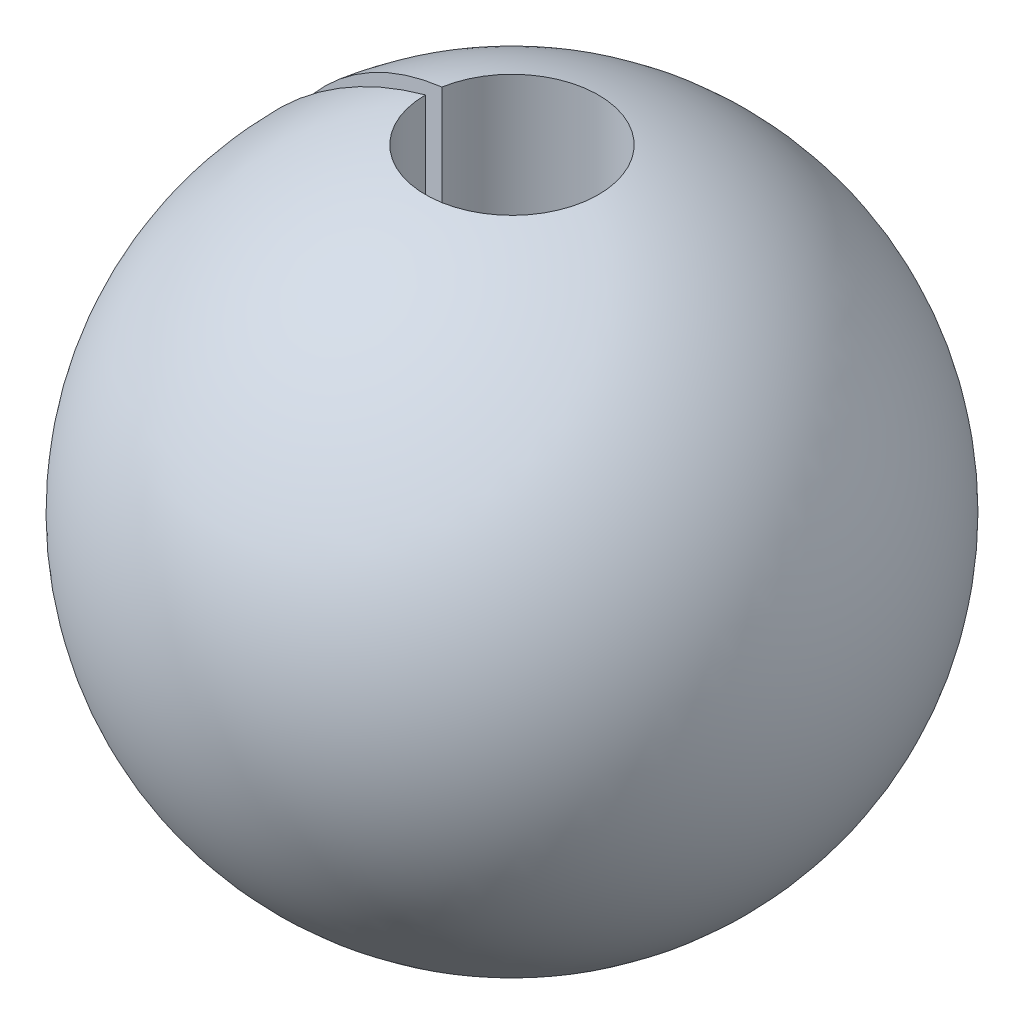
ISO-10303-21;
HEADER;
FILE_DESCRIPTION(('STEP AP214'),'2;1');
FILE_NAME('part.step','',(''),(''),'','','');
FILE_SCHEMA(('AUTOMOTIVE_DESIGN { 1 0 10303 214 1 1 1 1 }'));
ENDSEC;
DATA;
#1=APPLICATION_CONTEXT('core data for automotive mechanical design processes');
#2=APPLICATION_PROTOCOL_DEFINITION('international standard','automotive_design',2000,#1);
#3=PRODUCT_CONTEXT('',#1,'mechanical');
#4=PRODUCT('Part','Part','',(#3));
#5=PRODUCT_RELATED_PRODUCT_CATEGORY('part','',(#4));
#6=PRODUCT_DEFINITION_FORMATION('','',#4);
#7=PRODUCT_DEFINITION_CONTEXT('part definition',#1,'design');
#8=PRODUCT_DEFINITION('design','',#6,#7);
#9=PRODUCT_DEFINITION_SHAPE('','',#8);
#10=(LENGTH_UNIT() NAMED_UNIT(*) SI_UNIT(.MILLI.,.METRE.));
#11=(NAMED_UNIT(*) PLANE_ANGLE_UNIT() SI_UNIT($,.RADIAN.));
#12=(NAMED_UNIT(*) SI_UNIT($,.STERADIAN.) SOLID_ANGLE_UNIT());
#13=UNCERTAINTY_MEASURE_WITH_UNIT(LENGTH_MEASURE(1.E-05),#10,'distance_accuracy_value','');
#14=(GEOMETRIC_REPRESENTATION_CONTEXT(3) GLOBAL_UNCERTAINTY_ASSIGNED_CONTEXT((#13)) GLOBAL_UNIT_ASSIGNED_CONTEXT((#10,
#11,#12)) REPRESENTATION_CONTEXT('',''));
#15=CARTESIAN_POINT('',(0.,0.,0.));
#16=DIRECTION('',(0.,0.,1.));
#17=DIRECTION('',(1.,0.,0.));
#18=AXIS2_PLACEMENT_3D('',#15,#16,#17);
#19=CARTESIAN_POINT('',(0.,0.,0.));
#20=DIRECTION('',(0.,-1.,0.));
#21=DIRECTION('',(-0.98480775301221,0.,-0.173648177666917));
#22=AXIS2_PLACEMENT_3D('',#19,#20,#21);
#23=SPHERICAL_SURFACE('',#22,1403.);
#24=CARTESIAN_POINT('',(4.72703894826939E-12,-1353.87776405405,0.));
#25=DIRECTION('',(0.,-1.,0.));
#26=DIRECTION('',(1.,0.,0.));
#27=AXIS2_PLACEMENT_3D('',#24,#25,#26);
#28=CIRCLE('',#27,368.000000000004);
#29=CARTESIAN_POINT('',(-362.409253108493,-1353.87776405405,-63.9025293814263));
#30=VERTEX_POINT('',#29);
#31=CARTESIAN_POINT('',(-368.,-1353.87776405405,0.));
#32=VERTEX_POINT('',#31);
#33=EDGE_CURVE('E11',#30,#32,#28,.T.);
#34=ORIENTED_EDGE('',*,*,#33,.F.);
#35=CARTESIAN_POINT('',(0.,0.,0.));
#36=DIRECTION('',(-0.173648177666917,0.,0.98480775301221));
#37=DIRECTION('',(0.98480775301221,0.,0.173648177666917));
#38=AXIS2_PLACEMENT_3D('',#35,#36,#37);
#39=CIRCLE('',#38,1403.);
#40=CARTESIAN_POINT('',(-362.409253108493,1353.87776405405,-63.9025293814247));
#41=VERTEX_POINT('',#40);
#42=EDGE_CURVE('E67',#41,#30,#39,.T.);
#43=ORIENTED_EDGE('',*,*,#42,.F.);
#44=CARTESIAN_POINT('',(-4.72703894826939E-12,1353.87776405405,0.));
#45=DIRECTION('',(0.,-1.,0.));
#46=DIRECTION('',(1.,0.,0.));
#47=AXIS2_PLACEMENT_3D('',#44,#45,#46);
#48=CIRCLE('',#47,367.999999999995);
#49=CARTESIAN_POINT('',(-368.,1353.87776405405,0.));
#50=VERTEX_POINT('',#49);
#51=EDGE_CURVE('E42',#41,#50,#48,.T.);
#52=ORIENTED_EDGE('',*,*,#51,.T.);
#53=CARTESIAN_POINT('',(0.,0.,0.));
#54=DIRECTION('',(0.,0.,1.));
#55=DIRECTION('',(1.,0.,0.));
#56=AXIS2_PLACEMENT_3D('',#53,#54,#55);
#57=CIRCLE('',#56,1403.);
#58=EDGE_CURVE('E63',#50,#32,#57,.T.);
#59=ORIENTED_EDGE('',*,*,#58,.T.);
#60=EDGE_LOOP('',(#34,#43,#52,#59));
#61=FACE_BOUND('',#60,.T.);
#62=ADVANCED_FACE('F34',(#61),#23,.T.);
#63=CARTESIAN_POINT('',(3.49148133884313E-12,-1000.,0.));
#64=DIRECTION('',(0.,-1.,0.));
#65=DIRECTION('',(1.,0.,0.));
#66=AXIS2_PLACEMENT_3D('',#63,#64,#65);
#67=CYLINDRICAL_SURFACE('',#66,368.);
#68=DIRECTION('',(0.,1.,0.));
#69=VECTOR('',#68,1.);
#70=CARTESIAN_POINT('',(-362.409253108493,1353.87776405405,-63.9025293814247));
#71=LINE('',#70,#69);
#72=EDGE_CURVE('E61',#30,#41,#71,.T.);
#73=ORIENTED_EDGE('',*,*,#72,.F.);
#74=ORIENTED_EDGE('',*,*,#33,.T.);
#75=DIRECTION('',(0.,1.,0.));
#76=VECTOR('',#75,1.);
#77=CARTESIAN_POINT('',(-368.,1353.87776405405,0.));
#78=LINE('',#77,#76);
#79=EDGE_CURVE('E59',#32,#50,#78,.T.);
#80=ORIENTED_EDGE('',*,*,#79,.T.);
#81=ORIENTED_EDGE('',*,*,#51,.F.);
#82=EDGE_LOOP('',(#73,#74,#80,#81));
#83=FACE_BOUND('',#82,.T.);
#84=ADVANCED_FACE('F36',(#83),#67,.F.);
#85=CARTESIAN_POINT('',(0.,0.,0.));
#86=DIRECTION('',(-0.173648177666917,0.,0.98480775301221));
#87=DIRECTION('',(0.98480775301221,0.,0.173648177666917));
#88=AXIS2_PLACEMENT_3D('',#85,#86,#87);
#89=PLANE('',#88);
#90=ORIENTED_EDGE('',*,*,#42,.T.);
#91=ORIENTED_EDGE('',*,*,#72,.T.);
#92=EDGE_LOOP('',(#90,#91));
#93=FACE_BOUND('',#92,.T.);
#94=ADVANCED_FACE('F72',(#93),#89,.T.);
#95=CARTESIAN_POINT('',(0.,0.,0.));
#96=DIRECTION('',(0.,0.,1.));
#97=DIRECTION('',(1.,0.,0.));
#98=AXIS2_PLACEMENT_3D('',#95,#96,#97);
#99=PLANE('',#98);
#100=ORIENTED_EDGE('',*,*,#58,.F.);
#101=ORIENTED_EDGE('',*,*,#79,.F.);
#102=EDGE_LOOP('',(#100,#101));
#103=FACE_BOUND('',#102,.T.);
#104=ADVANCED_FACE('F66',(#103),#99,.F.);
#105=CLOSED_SHELL('',(#62,#84,#94,#104));
#106=MANIFOLD_SOLID_BREP('B2',#105);
#107=ADVANCED_BREP_SHAPE_REPRESENTATION('',(#18,#106),#14);
#108=SHAPE_DEFINITION_REPRESENTATION(#9,#107);
ENDSEC;
END-ISO-10303-21;
